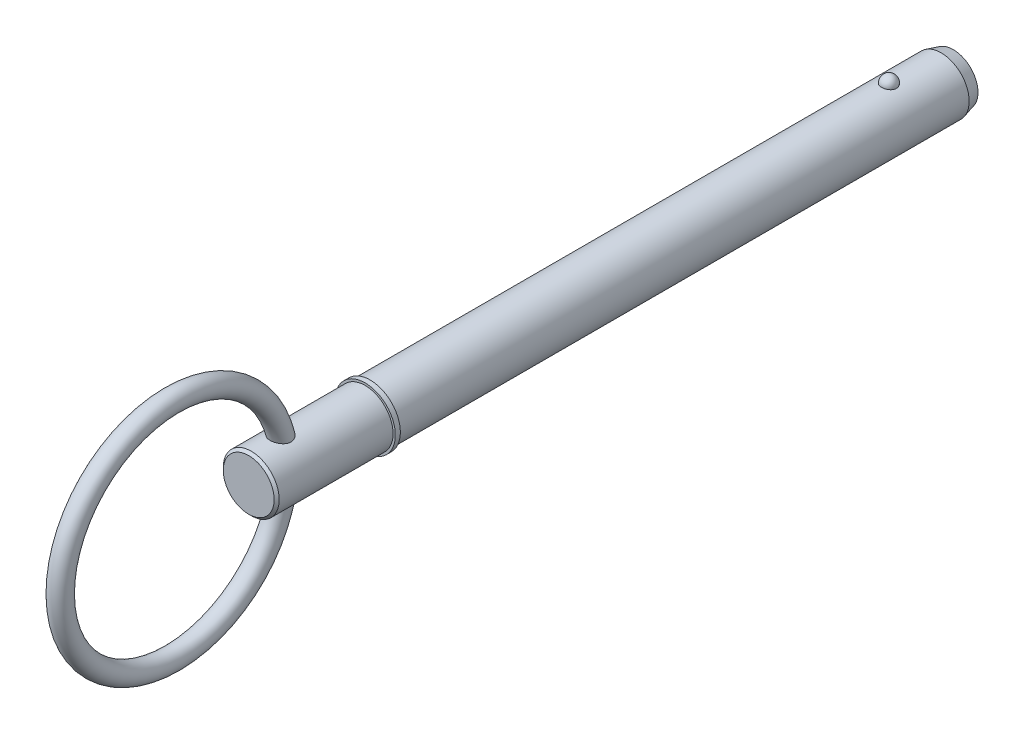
ISO-10303-21;
HEADER;
FILE_DESCRIPTION(('STEP AP214'),'2;1');
FILE_NAME('part.step','',(''),(''),'','','');
FILE_SCHEMA(('AUTOMOTIVE_DESIGN { 1 0 10303 214 1 1 1 1 }'));
ENDSEC;
DATA;
#1=APPLICATION_CONTEXT('core data for automotive mechanical design processes');
#2=APPLICATION_PROTOCOL_DEFINITION('international standard','automotive_design',2000,#1);
#3=PRODUCT_CONTEXT('',#1,'mechanical');
#4=PRODUCT('Part','Part','',(#3));
#5=PRODUCT_RELATED_PRODUCT_CATEGORY('part','',(#4));
#6=PRODUCT_DEFINITION_FORMATION('','',#4);
#7=PRODUCT_DEFINITION_CONTEXT('part definition',#1,'design');
#8=PRODUCT_DEFINITION('design','',#6,#7);
#9=PRODUCT_DEFINITION_SHAPE('','',#8);
#10=(LENGTH_UNIT() NAMED_UNIT(*) SI_UNIT(.MILLI.,.METRE.));
#11=(NAMED_UNIT(*) PLANE_ANGLE_UNIT() SI_UNIT($,.RADIAN.));
#12=(NAMED_UNIT(*) SI_UNIT($,.STERADIAN.) SOLID_ANGLE_UNIT());
#13=UNCERTAINTY_MEASURE_WITH_UNIT(LENGTH_MEASURE(1.E-05),#10,'distance_accuracy_value','');
#14=(GEOMETRIC_REPRESENTATION_CONTEXT(3) GLOBAL_UNCERTAINTY_ASSIGNED_CONTEXT((#13)) GLOBAL_UNIT_ASSIGNED_CONTEXT((#10,
#11,#12)) REPRESENTATION_CONTEXT('',''));
#15=CARTESIAN_POINT('',(0.,0.,0.));
#16=DIRECTION('',(0.,0.,1.));
#17=DIRECTION('',(1.,0.,0.));
#18=AXIS2_PLACEMENT_3D('',#15,#16,#17);
#19=CARTESIAN_POINT('',(0.,0.,101.6));
#20=DIRECTION('',(0.,0.,-1.));
#21=DIRECTION('',(-1.,0.,0.));
#22=AXIS2_PLACEMENT_3D('',#19,#20,#21);
#23=CYLINDRICAL_SURFACE('',#22,5.555);
#24=CARTESIAN_POINT('',(1.47653932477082,5.35517101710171,-1.49));
#25=CARTESIAN_POINT('',(1.4765376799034,5.35517235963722,-1.40667872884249));
#26=CARTESIAN_POINT('',(1.4697233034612,5.35706459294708,-1.32333626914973));
#27=CARTESIAN_POINT('',(1.4426291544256,5.36442332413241,-1.15900769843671));
#28=CARTESIAN_POINT('',(1.42234344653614,5.36989139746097,-1.07802264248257));
#29=CARTESIAN_POINT('',(1.36882802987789,5.38378061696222,-0.920757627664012));
#30=CARTESIAN_POINT('',(1.33560404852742,5.39220045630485,-0.844475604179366));
#31=CARTESIAN_POINT('',(1.25704906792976,5.41105136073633,-0.698703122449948));
#32=CARTESIAN_POINT('',(1.21171855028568,5.42148234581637,-0.629212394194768));
#33=CARTESIAN_POINT('',(1.10986325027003,5.44324765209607,-0.498626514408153));
#34=CARTESIAN_POINT('',(1.05328868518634,5.45458585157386,-0.437570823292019));
#35=CARTESIAN_POINT('',(0.930545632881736,5.4768596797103,-0.325918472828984));
#36=CARTESIAN_POINT('',(0.864377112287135,5.48779530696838,-0.275321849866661));
#37=CARTESIAN_POINT('',(0.724412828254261,5.50801510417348,-0.186125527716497));
#38=CARTESIAN_POINT('',(0.650637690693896,5.51730356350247,-0.147494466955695));
#39=CARTESIAN_POINT('',(0.497383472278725,5.53322345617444,-0.0831582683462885));
#40=CARTESIAN_POINT('',(0.417904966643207,5.53985515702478,-0.0574518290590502));
#41=CARTESIAN_POINT('',(0.256903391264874,5.54963245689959,-0.0200294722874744));
#42=CARTESIAN_POINT('',(0.17543580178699,5.55283384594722,-0.00808940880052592));
#43=CARTESIAN_POINT('',(0.011588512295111,5.55559187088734,0.00221439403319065));
#44=CARTESIAN_POINT('',(-0.0707911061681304,5.55514883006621,0.000579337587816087));
#45=CARTESIAN_POINT('',(-0.232980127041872,5.55069756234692,-0.0161051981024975));
#46=CARTESIAN_POINT('',(-0.312809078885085,5.54673626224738,-0.0309781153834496));
#47=CARTESIAN_POINT('',(-0.468771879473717,5.5357377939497,-0.0734743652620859));
#48=CARTESIAN_POINT('',(-0.544905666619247,5.52870057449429,-0.101097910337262));
#49=CARTESIAN_POINT('',(-0.691800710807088,5.51225307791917,-0.168516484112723));
#50=CARTESIAN_POINT('',(-0.762530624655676,5.50283015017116,-0.2083766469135));
#51=CARTESIAN_POINT('',(-0.896294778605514,5.48263289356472,-0.299136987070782));
#52=CARTESIAN_POINT('',(-0.959328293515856,5.47185843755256,-0.350038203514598));
#53=CARTESIAN_POINT('',(-1.07712789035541,5.44990641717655,-0.462517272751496));
#54=CARTESIAN_POINT('',(-1.13172901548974,5.43872509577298,-0.524267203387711));
#55=CARTESIAN_POINT('',(-1.2299173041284,5.41736658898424,-0.656133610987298));
#56=CARTESIAN_POINT('',(-1.2735037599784,5.40718946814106,-0.726250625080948));
#57=CARTESIAN_POINT('',(-1.34896420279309,5.38886361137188,-0.873713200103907));
#58=CARTESIAN_POINT('',(-1.38071142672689,5.38073711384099,-0.951126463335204));
#59=CARTESIAN_POINT('',(-1.4310375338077,5.36757288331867,-1.11037033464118));
#60=CARTESIAN_POINT('',(-1.44961676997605,5.3625350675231,-1.19220082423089));
#61=CARTESIAN_POINT('',(-1.47308754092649,5.35613553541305,-1.35761209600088));
#62=CARTESIAN_POINT('',(-1.47803294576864,5.35475935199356,-1.44118467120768));
#63=CARTESIAN_POINT('',(-1.47426441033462,5.35579807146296,-1.6079958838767));
#64=CARTESIAN_POINT('',(-1.46555080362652,5.35821288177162,-1.69123452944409));
#65=CARTESIAN_POINT('',(-1.43475662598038,5.36653964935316,-1.8546288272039));
#66=CARTESIAN_POINT('',(-1.41273621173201,5.37243586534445,-1.93479663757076));
#67=CARTESIAN_POINT('',(-1.35593151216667,5.38705199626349,-2.09020110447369));
#68=CARTESIAN_POINT('',(-1.32114675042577,5.39577201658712,-2.16543757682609));
#69=CARTESIAN_POINT('',(-1.23947506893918,5.41511674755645,-2.30926926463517));
#70=CARTESIAN_POINT('',(-1.1925277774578,5.42575087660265,-2.37782893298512));
#71=CARTESIAN_POINT('',(-1.08780725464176,5.44771095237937,-2.50598876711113));
#72=CARTESIAN_POINT('',(-1.03003365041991,5.4590369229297,-2.56558862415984));
#73=CARTESIAN_POINT('',(-0.90495349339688,5.48116073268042,-2.67436535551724));
#74=CARTESIAN_POINT('',(-0.837616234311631,5.49195671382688,-2.7235073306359));
#75=CARTESIAN_POINT('',(-0.69537970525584,5.51177099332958,-2.8097317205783));
#76=CARTESIAN_POINT('',(-0.620480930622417,5.52078940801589,-2.84681492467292));
#77=CARTESIAN_POINT('',(-0.466144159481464,5.53594369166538,-2.90749751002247));
#78=CARTESIAN_POINT('',(-0.386768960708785,5.54211181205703,-2.93124844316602));
#79=CARTESIAN_POINT('',(-0.224991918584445,5.5510324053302,-2.96523308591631));
#80=CARTESIAN_POINT('',(-0.142590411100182,5.55378525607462,-2.97546829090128));
#81=CARTESIAN_POINT('',(0.0213711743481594,5.55555351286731,-2.98206550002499));
#82=CARTESIAN_POINT('',(0.102921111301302,5.55463281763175,-2.97866468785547));
#83=CARTESIAN_POINT('',(0.2642564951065,5.54929804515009,-2.95862186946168));
#84=CARTESIAN_POINT('',(0.344041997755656,5.54488407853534,-2.94198028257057));
#85=CARTESIAN_POINT('',(0.499344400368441,5.53305794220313,-2.89600357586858));
#86=CARTESIAN_POINT('',(0.574874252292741,5.52565550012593,-2.86670961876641));
#87=CARTESIAN_POINT('',(0.71989857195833,5.50863937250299,-2.79624249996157));
#88=CARTESIAN_POINT('',(0.78939269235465,5.49902555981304,-2.75506865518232));
#89=CARTESIAN_POINT('',(0.921480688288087,5.47845199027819,-2.66127110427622));
#90=CARTESIAN_POINT('',(0.983960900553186,5.46747485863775,-2.60849118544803));
#91=CARTESIAN_POINT('',(1.09925057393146,5.44546837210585,-2.49325304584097));
#92=CARTESIAN_POINT('',(1.15205830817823,5.43443900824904,-2.43079310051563));
#93=CARTESIAN_POINT('',(1.24742943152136,5.41335152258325,-2.29680711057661));
#94=CARTESIAN_POINT('',(1.28981661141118,5.40331162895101,-2.22515272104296));
#95=CARTESIAN_POINT('',(1.36214937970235,5.38553336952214,-2.07558035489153));
#96=CARTESIAN_POINT('',(1.39210034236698,5.37779400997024,-1.99766510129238));
#97=CARTESIAN_POINT('',(1.43569518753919,5.36630594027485,-1.84848338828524));
#98=CARTESIAN_POINT('',(1.45098536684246,5.36216169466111,-1.77772322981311));
#99=CARTESIAN_POINT('',(1.47140805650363,5.35659367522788,-1.63464735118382));
#100=CARTESIAN_POINT('',(1.47654075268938,5.35516985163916,-1.5623316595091));
#101=CARTESIAN_POINT('',(1.47653932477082,5.35517101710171,-1.49));
#102=B_SPLINE_CURVE_WITH_KNOTS('',3,(#24,#25,#26,#27,#28,#29,#30,#31,#32,#33,#34,#35,#36,#37,
#38,#39,#40,#41,#42,#43,#44,#45,#46,#47,#48,#49,#50,#51,#52,#53,#54,#55,#56,#57,#58,#59,#60,#61,
#62,#63,#64,#65,#66,#67,#68,#69,#70,#71,#72,#73,#74,#75,#76,#77,#78,#79,#80,#81,#82,#83,#84,#85,
#86,#87,#88,#89,#90,#91,#92,#93,#94,#95,#96,#97,#98,#99,#100,#101),.UNSPECIFIED.,.T.,.F.,(4,2,2,
2,2,2,2,2,2,2,2,2,2,2,2,2,2,2,2,2,2,2,2,2,2,2,2,2,2,2,2,2,2,2,2,2,2,2,4),(0.,0.249703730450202,
0.4995175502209,0.749220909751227,0.998914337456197,1.24973894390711,1.50056442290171,
1.75072681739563,2.00086401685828,2.24686822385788,2.49285060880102,2.73560052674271,
2.97835449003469,3.22242369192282,3.46651587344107,3.71490232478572,3.96330473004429,
4.21429522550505,4.46527899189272,4.71526963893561,4.96525418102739,5.21411697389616,
5.46298905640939,5.71312097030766,5.96326150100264,6.21422412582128,6.46517032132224,
6.71320296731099,6.96120816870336,7.20491846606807,7.44862104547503,7.69153667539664,
7.93446627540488,8.18089104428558,8.42735976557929,8.67774679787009,8.92802551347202,
9.14479867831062,9.36156787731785),.UNSPECIFIED.);
#103=CARTESIAN_POINT('',(1.47653932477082,5.35517101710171,-1.49));
#104=VERTEX_POINT('',#103);
#105=EDGE_CURVE('E101',#104,#104,#102,.T.);
#106=ORIENTED_EDGE('',*,*,#105,.T.);
#107=EDGE_LOOP('',(#106));
#108=FACE_BOUND('',#107,.T.);
#109=CARTESIAN_POINT('',(0.,0.,-11.87));
#110=DIRECTION('',(0.,0.,-1.));
#111=DIRECTION('',(-1.,0.,0.));
#112=AXIS2_PLACEMENT_3D('',#109,#110,#111);
#113=CIRCLE('',#112,5.555);
#114=CARTESIAN_POINT('',(5.555,0.,-11.87));
#115=VERTEX_POINT('',#114);
#116=EDGE_CURVE('E109',#115,#115,#113,.F.);
#117=ORIENTED_EDGE('',*,*,#116,.T.);
#118=EDGE_LOOP('',(#117));
#119=FACE_BOUND('',#118,.T.);
#120=CARTESIAN_POINT('',(0.,0.,101.6));
#121=DIRECTION('',(0.,0.,1.));
#122=DIRECTION('',(1.,0.,0.));
#123=AXIS2_PLACEMENT_3D('',#120,#121,#122);
#124=CIRCLE('',#123,5.555);
#125=CARTESIAN_POINT('',(5.555,0.,101.6));
#126=VERTEX_POINT('',#125);
#127=EDGE_CURVE('E107',#126,#126,#124,.T.);
#128=ORIENTED_EDGE('',*,*,#127,.F.);
#129=EDGE_LOOP('',(#128));
#130=FACE_BOUND('',#129,.T.);
#131=ADVANCED_FACE('F39',(#108,#119,#130),#23,.T.);
#132=CARTESIAN_POINT('',(0.,0.,-14.27));
#133=DIRECTION('',(0.,0.,-1.));
#134=DIRECTION('',(-1.,0.,0.));
#135=AXIS2_PLACEMENT_3D('',#132,#133,#134);
#136=PLANE('',#135);
#137=CARTESIAN_POINT('',(0.,0.,-14.27));
#138=DIRECTION('',(0.,0.,-1.));
#139=DIRECTION('',(-1.,0.,0.));
#140=AXIS2_PLACEMENT_3D('',#137,#138,#139);
#141=CIRCLE('',#140,4.91192193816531);
#142=CARTESIAN_POINT('',(4.91192193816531,0.,-14.27));
#143=VERTEX_POINT('',#142);
#144=EDGE_CURVE('E142',#143,#143,#141,.T.);
#145=ORIENTED_EDGE('',*,*,#144,.T.);
#146=EDGE_LOOP('',(#145));
#147=FACE_BOUND('',#146,.T.);
#148=ADVANCED_FACE('F87',(#147),#136,.T.);
#149=CARTESIAN_POINT('',(0.,0.,-14.27));
#150=DIRECTION('',(0.,0.,1.));
#151=DIRECTION('',(1.,0.,0.));
#152=AXIS2_PLACEMENT_3D('',#149,#150,#151);
#153=CONICAL_SURFACE('',#152,4.91192193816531,0.261799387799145);
#154=CARTESIAN_POINT('',(5.555,0.,-11.87));
#155=CARTESIAN_POINT('',(5.54830127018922,0.,-11.895));
#156=CARTESIAN_POINT('',(5.54160254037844,0.,-11.92));
#157=CARTESIAN_POINT('',(5.52820508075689,0.,-11.97));
#158=CARTESIAN_POINT('',(5.52150635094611,0.,-11.995));
#159=CARTESIAN_POINT('',(5.50810889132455,0.,-12.045));
#160=CARTESIAN_POINT('',(5.50141016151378,0.,-12.07));
#161=CARTESIAN_POINT('',(5.48801270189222,0.,-12.12));
#162=CARTESIAN_POINT('',(5.48131397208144,0.,-12.145));
#163=CARTESIAN_POINT('',(5.46791651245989,0.,-12.195));
#164=CARTESIAN_POINT('',(5.46121778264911,0.,-12.22));
#165=CARTESIAN_POINT('',(5.44782032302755,0.,-12.27));
#166=CARTESIAN_POINT('',(5.44112159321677,0.,-12.295));
#167=CARTESIAN_POINT('',(5.42772413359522,0.,-12.345));
#168=CARTESIAN_POINT('',(5.42102540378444,0.,-12.37));
#169=CARTESIAN_POINT('',(5.40762794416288,0.,-12.42));
#170=CARTESIAN_POINT('',(5.40092921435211,0.,-12.445));
#171=CARTESIAN_POINT('',(5.38753175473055,0.,-12.495));
#172=CARTESIAN_POINT('',(5.38083302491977,0.,-12.52));
#173=CARTESIAN_POINT('',(5.36743556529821,0.,-12.57));
#174=CARTESIAN_POINT('',(5.36073683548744,0.,-12.595));
#175=CARTESIAN_POINT('',(5.34733937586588,0.,-12.645));
#176=CARTESIAN_POINT('',(5.3406406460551,0.,-12.67));
#177=CARTESIAN_POINT('',(5.32724318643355,0.,-12.72));
#178=CARTESIAN_POINT('',(5.32054445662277,0.,-12.745));
#179=CARTESIAN_POINT('',(5.30714699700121,0.,-12.795));
#180=CARTESIAN_POINT('',(5.30044826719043,0.,-12.82));
#181=CARTESIAN_POINT('',(5.28705080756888,0.,-12.87));
#182=CARTESIAN_POINT('',(5.2803520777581,0.,-12.895));
#183=CARTESIAN_POINT('',(5.26695461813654,0.,-12.945));
#184=CARTESIAN_POINT('',(5.26025588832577,0.,-12.97));
#185=CARTESIAN_POINT('',(5.24685842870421,0.,-13.02));
#186=CARTESIAN_POINT('',(5.24015969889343,0.,-13.045));
#187=CARTESIAN_POINT('',(5.22676223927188,0.,-13.095));
#188=CARTESIAN_POINT('',(5.2200635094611,0.,-13.12));
#189=CARTESIAN_POINT('',(5.20666604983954,0.,-13.17));
#190=CARTESIAN_POINT('',(5.19996732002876,0.,-13.195));
#191=CARTESIAN_POINT('',(5.18656986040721,0.,-13.245));
#192=CARTESIAN_POINT('',(5.17987113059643,0.,-13.27));
#193=CARTESIAN_POINT('',(5.16647367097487,0.,-13.32));
#194=CARTESIAN_POINT('',(5.1597749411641,0.,-13.345));
#195=CARTESIAN_POINT('',(5.14637748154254,0.,-13.395));
#196=CARTESIAN_POINT('',(5.13967875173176,0.,-13.42));
#197=CARTESIAN_POINT('',(5.12628129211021,0.,-13.47));
#198=CARTESIAN_POINT('',(5.11958256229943,0.,-13.495));
#199=CARTESIAN_POINT('',(5.10618510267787,0.,-13.545));
#200=CARTESIAN_POINT('',(5.09948637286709,0.,-13.57));
#201=CARTESIAN_POINT('',(5.08608891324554,0.,-13.62));
#202=CARTESIAN_POINT('',(5.07939018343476,0.,-13.645));
#203=CARTESIAN_POINT('',(5.0659927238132,0.,-13.695));
#204=CARTESIAN_POINT('',(5.05929399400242,0.,-13.72));
#205=CARTESIAN_POINT('',(5.04589653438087,0.,-13.77));
#206=CARTESIAN_POINT('',(5.03919780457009,0.,-13.795));
#207=CARTESIAN_POINT('',(5.02580034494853,0.,-13.845));
#208=CARTESIAN_POINT('',(5.01910161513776,0.,-13.87));
#209=CARTESIAN_POINT('',(5.0057041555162,0.,-13.92));
#210=CARTESIAN_POINT('',(4.99900542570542,0.,-13.945));
#211=CARTESIAN_POINT('',(4.98560796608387,0.,-13.995));
#212=CARTESIAN_POINT('',(4.97890923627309,0.,-14.02));
#213=CARTESIAN_POINT('',(4.96551177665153,0.,-14.07));
#214=CARTESIAN_POINT('',(4.95881304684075,0.,-14.095));
#215=CARTESIAN_POINT('',(4.9454155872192,0.,-14.145));
#216=CARTESIAN_POINT('',(4.93871685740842,0.,-14.17));
#217=CARTESIAN_POINT('',(4.92531939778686,0.,-14.22));
#218=CARTESIAN_POINT('',(4.91862066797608,0.,-14.245));
#219=CARTESIAN_POINT('',(4.91192193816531,0.,-14.27));
#220=B_SPLINE_CURVE_WITH_KNOTS('',3,(#154,#155,#156,#157,#158,#159,#160,#161,#162,#163,#164,
#165,#166,#167,#168,#169,#170,#171,#172,#173,#174,#175,#176,#177,#178,#179,#180,#181,#182,#183,
#184,#185,#186,#187,#188,#189,#190,#191,#192,#193,#194,#195,#196,#197,#198,#199,#200,#201,#202,
#203,#204,#205,#206,#207,#208,#209,#210,#211,#212,#213,#214,#215,#216,#217,#218,#219),
.UNSPECIFIED.,.F.,.F.,(4,2,2,2,2,2,2,2,2,2,2,2,2,2,2,2,2,2,2,2,2,2,2,2,2,2,2,2,2,2,2,2,4),(0.,
0.0776457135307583,0.155291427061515,0.232937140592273,0.31058285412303,0.388228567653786,
0.465874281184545,0.543519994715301,0.621165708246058,0.698811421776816,0.776457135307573,
0.854102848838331,0.931748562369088,1.00939427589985,1.0870399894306,1.16468570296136,
1.24233141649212,1.31997713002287,1.39762284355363,1.47526855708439,1.55291427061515,
1.6305599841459,1.70820569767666,1.78585141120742,1.86349712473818,1.94114283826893,
2.01878855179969,2.09643426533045,2.17407997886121,2.25172569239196,2.32937140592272,
2.40701711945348,2.48466283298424),.UNSPECIFIED.);
#221=EDGE_CURVE('BSEAM93',#115,#143,#220,.T.);
#222=ORIENTED_EDGE('',*,*,#116,.F.);
#223=ORIENTED_EDGE('',*,*,#144,.F.);
#224=ORIENTED_EDGE('',*,*,#221,.T.);
#225=ORIENTED_EDGE('',*,*,#221,.F.);
#226=EDGE_LOOP('',(#222,#224,#223,#225));
#227=FACE_BOUND('',#226,.T.);
#228=ADVANCED_FACE('F93',(#227),#153,.T.);
#229=CARTESIAN_POINT('',(0.,5.555,-1.49));
#230=DIRECTION('',(0.,1.,0.));
#231=DIRECTION('',(0.,0.,1.));
#232=AXIS2_PLACEMENT_3D('',#229,#230,#231);
#233=SPHERICAL_SURFACE('',#232,1.49);
#234=ORIENTED_EDGE('',*,*,#105,.F.);
#235=EDGE_LOOP('',(#234));
#236=FACE_BOUND('',#235,.T.);
#237=ADVANCED_FACE('F112',(#236),#233,.T.);
#238=CARTESIAN_POINT('',(0.,0.,101.6));
#239=DIRECTION('',(0.,0.,-1.));
#240=DIRECTION('',(-1.,0.,0.));
#241=AXIS2_PLACEMENT_3D('',#238,#239,#240);
#242=PLANE('',#241);
#243=ORIENTED_EDGE('',*,*,#127,.T.);
#244=EDGE_LOOP('',(#243));
#245=FACE_BOUND('',#244,.T.);
#246=CARTESIAN_POINT('',(0.,0.,101.6));
#247=DIRECTION('',(0.,0.,-1.));
#248=DIRECTION('',(-1.,0.,0.));
#249=AXIS2_PLACEMENT_3D('',#246,#247,#248);
#250=CIRCLE('',#249,6.);
#251=CARTESIAN_POINT('',(-6.,0.,101.6));
#252=VERTEX_POINT('',#251);
#253=EDGE_CURVE('E108',#252,#252,#250,.T.);
#254=ORIENTED_EDGE('',*,*,#253,.T.);
#255=EDGE_LOOP('',(#254));
#256=FACE_BOUND('',#255,.T.);
#257=ADVANCED_FACE('F116',(#245,#256),#242,.T.);
#258=CARTESIAN_POINT('',(0.,0.,33.7287874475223));
#259=DIRECTION('',(0.,0.,-1.));
#260=DIRECTION('',(-1.,0.,0.));
#261=AXIS2_PLACEMENT_3D('',#258,#259,#260);
#262=CYLINDRICAL_SURFACE('',#261,6.);
#263=CARTESIAN_POINT('',(0.,0.,102.6));
#264=DIRECTION('',(0.,0.,-1.));
#265=DIRECTION('',(-1.,0.,0.));
#266=AXIS2_PLACEMENT_3D('',#263,#264,#265);
#267=CIRCLE('',#266,6.);
#268=CARTESIAN_POINT('',(-6.,0.,102.6));
#269=VERTEX_POINT('',#268);
#270=EDGE_CURVE('E133',#269,#269,#267,.T.);
#271=ORIENTED_EDGE('',*,*,#270,.T.);
#272=EDGE_LOOP('',(#271));
#273=FACE_BOUND('',#272,.T.);
#274=ORIENTED_EDGE('',*,*,#253,.F.);
#275=EDGE_LOOP('',(#274));
#276=FACE_BOUND('',#275,.T.);
#277=ADVANCED_FACE('F120',(#273,#276),#262,.T.);
#278=CARTESIAN_POINT('',(0.,6.,102.6));
#279=DIRECTION('',(0.,0.,1.));
#280=DIRECTION('',(1.,0.,0.));
#281=AXIS2_PLACEMENT_3D('',#278,#279,#280);
#282=PLANE('',#281);
#283=CARTESIAN_POINT('',(0.,0.,102.6));
#284=DIRECTION('',(0.,0.,1.));
#285=DIRECTION('',(1.,0.,0.));
#286=AXIS2_PLACEMENT_3D('',#283,#284,#285);
#287=CIRCLE('',#286,5.555);
#288=CARTESIAN_POINT('',(5.555,0.,102.6));
#289=VERTEX_POINT('',#288);
#290=EDGE_CURVE('E111',#289,#289,#287,.T.);
#291=ORIENTED_EDGE('',*,*,#290,.F.);
#292=EDGE_LOOP('',(#291));
#293=FACE_BOUND('',#292,.T.);
#294=ORIENTED_EDGE('',*,*,#270,.F.);
#295=EDGE_LOOP('',(#294));
#296=FACE_BOUND('',#295,.T.);
#297=ADVANCED_FACE('F84',(#293,#296),#282,.T.);
#298=CARTESIAN_POINT('',(0.,0.,125.73));
#299=DIRECTION('',(0.,0.,-1.));
#300=DIRECTION('',(-1.,0.,0.));
#301=AXIS2_PLACEMENT_3D('',#298,#299,#300);
#302=CYLINDRICAL_SURFACE('',#301,5.555);
#303=CARTESIAN_POINT('',(-0.961380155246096,-5.47117658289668,117.608733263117));
#304=CARTESIAN_POINT('',(-0.863231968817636,-5.48842171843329,117.557515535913));
#305=CARTESIAN_POINT('',(-0.7605484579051,-5.50372118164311,117.514318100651));
#306=CARTESIAN_POINT('',(-0.548956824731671,-5.52883500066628,117.444912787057));
#307=CARTESIAN_POINT('',(-0.440048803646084,-5.53864944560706,117.418704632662));
#308=CARTESIAN_POINT('',(-0.219033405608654,-5.55178384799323,117.383864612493));
#309=CARTESIAN_POINT('',(-0.106925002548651,-5.55510169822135,117.375238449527));
#310=CARTESIAN_POINT('',(0.11723899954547,-5.55489351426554,117.375783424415));
#311=CARTESIAN_POINT('',(0.229294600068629,-5.55136768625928,117.384954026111));
#312=CARTESIAN_POINT('',(0.449588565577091,-5.5378711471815,117.420784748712));
#313=CARTESIAN_POINT('',(0.557843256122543,-5.52793284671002,117.447356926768));
#314=CARTESIAN_POINT('',(0.768116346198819,-5.50265785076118,117.517309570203));
#315=CARTESIAN_POINT('',(0.87013418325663,-5.48732066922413,117.560691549));
#316=CARTESIAN_POINT('',(1.06580880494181,-5.45270790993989,117.663685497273));
#317=CARTESIAN_POINT('',(1.1594033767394,-5.43340601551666,117.723406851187));
#318=CARTESIAN_POINT('',(1.33484934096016,-5.39298781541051,117.857672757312));
#319=CARTESIAN_POINT('',(1.41670019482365,-5.37187142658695,117.932217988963));
#320=CARTESIAN_POINT('',(1.56628651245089,-5.33017932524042,118.094433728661));
#321=CARTESIAN_POINT('',(1.63402728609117,-5.30960341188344,118.182099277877));
#322=CARTESIAN_POINT('',(1.7533832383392,-5.27139606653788,118.36835593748));
#323=CARTESIAN_POINT('',(1.80500413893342,-5.25376359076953,118.466943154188));
#324=CARTESIAN_POINT('',(1.88923054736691,-5.22405733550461,118.668866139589));
#325=CARTESIAN_POINT('',(1.92240068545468,-5.21182119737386,118.771942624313));
#326=CARTESIAN_POINT('',(1.97156802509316,-5.19342304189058,118.982612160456));
#327=CARTESIAN_POINT('',(1.98756752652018,-5.18726021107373,119.090204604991));
#328=CARTESIAN_POINT('',(2.00238957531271,-5.1815556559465,119.304813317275));
#329=CARTESIAN_POINT('',(2.0015062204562,-5.18190056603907,119.411807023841));
#330=CARTESIAN_POINT('',(1.98404322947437,-5.18861029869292,119.624294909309));
#331=CARTESIAN_POINT('',(1.96745884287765,-5.19497694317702,119.72978862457));
#332=CARTESIAN_POINT('',(1.91810947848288,-5.21340722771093,119.943734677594));
#333=CARTESIAN_POINT('',(1.88435438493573,-5.22581720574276,120.051927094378));
#334=CARTESIAN_POINT('',(1.80161540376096,-5.25491400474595,120.261718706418));
#335=CARTESIAN_POINT('',(1.75262312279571,-5.27160318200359,120.363314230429));
#336=CARTESIAN_POINT('',(1.63431251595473,-5.30955034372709,120.568856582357));
#337=CARTESIAN_POINT('',(1.56333412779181,-5.33111051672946,120.671796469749));
#338=CARTESIAN_POINT('',(1.40529607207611,-5.37493145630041,120.86447165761));
#339=CARTESIAN_POINT('',(1.31822569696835,-5.39719268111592,120.954198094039));
#340=CARTESIAN_POINT('',(1.12728892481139,-5.44031451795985,121.119004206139));
#341=CARTESIAN_POINT('',(1.02309899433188,-5.46113424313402,121.193723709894));
#342=CARTESIAN_POINT('',(0.801576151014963,-5.49800171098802,121.321805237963));
#343=CARTESIAN_POINT('',(0.684264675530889,-5.51405708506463,121.375201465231));
#344=CARTESIAN_POINT('',(0.456877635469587,-5.53719478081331,121.450980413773));
#345=CARTESIAN_POINT('',(0.34797457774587,-5.54519800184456,121.476584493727));
#346=CARTESIAN_POINT('',(0.12704223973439,-5.55464249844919,121.506731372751));
#347=CARTESIAN_POINT('',(0.0150164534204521,-5.55609083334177,121.511296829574));
#348=CARTESIAN_POINT('',(-0.191993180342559,-5.55250986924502,121.499911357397));
#349=CARTESIAN_POINT('',(-0.287160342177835,-5.54836194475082,121.486752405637));
#350=CARTESIAN_POINT('',(-0.473863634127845,-5.53554271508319,121.445489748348));
#351=CARTESIAN_POINT('',(-0.565399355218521,-5.52687090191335,121.417384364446));
#352=CARTESIAN_POINT('',(-0.743786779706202,-5.50572322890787,121.347293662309));
#353=CARTESIAN_POINT('',(-0.830566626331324,-5.49320168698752,121.305141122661));
#354=CARTESIAN_POINT('',(-0.996720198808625,-5.46549909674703,121.208875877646));
#355=CARTESIAN_POINT('',(-1.07609119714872,-5.45031707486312,121.154758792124));
#356=CARTESIAN_POINT('',(-1.23672272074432,-5.41628785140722,121.028211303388));
#357=CARTESIAN_POINT('',(-1.31676039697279,-5.39722327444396,120.95428911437));
#358=CARTESIAN_POINT('',(-1.46504263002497,-5.3588760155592,120.795462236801));
#359=CARTESIAN_POINT('',(-1.53327828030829,-5.33959318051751,120.710549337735));
#360=CARTESIAN_POINT('',(-1.6660227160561,-5.29979878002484,120.518697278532));
#361=CARTESIAN_POINT('',(-1.72857256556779,-5.27951148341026,120.410347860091));
#362=CARTESIAN_POINT('',(-1.83559571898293,-5.24326402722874,120.184325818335));
#363=CARTESIAN_POINT('',(-1.88006296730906,-5.22730531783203,120.066650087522));
#364=CARTESIAN_POINT('',(-1.94988009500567,-5.20167534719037,119.822087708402));
#365=CARTESIAN_POINT('',(-1.97477410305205,-5.19215470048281,119.69505279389));
#366=CARTESIAN_POINT('',(-2.00168294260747,-5.18184594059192,119.438249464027));
#367=CARTESIAN_POINT('',(-2.0037221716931,-5.18104851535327,119.30848411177));
#368=CARTESIAN_POINT('',(-1.98467753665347,-5.18836681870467,119.064652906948));
#369=CARTESIAN_POINT('',(-1.96600067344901,-5.19555485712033,118.950370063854));
#370=CARTESIAN_POINT('',(-1.90923541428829,-5.21668050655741,118.727389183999));
#371=CARTESIAN_POINT('',(-1.87115335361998,-5.23061591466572,118.618689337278));
#372=CARTESIAN_POINT('',(-1.78015350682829,-5.26224244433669,118.418371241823));
#373=CARTESIAN_POINT('',(-1.72857344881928,-5.27957041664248,118.32608293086));
#374=CARTESIAN_POINT('',(-1.61106729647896,-5.31660340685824,118.151684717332));
#375=CARTESIAN_POINT('',(-1.54514024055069,-5.33630858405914,118.069575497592));
#376=CARTESIAN_POINT('',(-1.39929408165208,-5.37641320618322,117.915887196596));
#377=CARTESIAN_POINT('',(-1.31912544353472,-5.39681868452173,117.844546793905));
#378=CARTESIAN_POINT('',(-1.14786008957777,-5.43582099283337,117.715855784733));
#379=CARTESIAN_POINT('',(-1.05676174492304,-5.4544175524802,117.658507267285));
#380=CARTESIAN_POINT('',(-0.961380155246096,-5.47117658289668,117.608733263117));
#381=B_SPLINE_CURVE_WITH_KNOTS('',3,(#303,#304,#305,#306,#307,#308,#309,#310,#311,#312,#313,
#314,#315,#316,#317,#318,#319,#320,#321,#322,#323,#324,#325,#326,#327,#328,#329,#330,#331,#332,
#333,#334,#335,#336,#337,#338,#339,#340,#341,#342,#343,#344,#345,#346,#347,#348,#349,#350,#351,
#352,#353,#354,#355,#356,#357,#358,#359,#360,#361,#362,#363,#364,#365,#366,#367,#368,#369,#370,
#371,#372,#373,#374,#375,#376,#377,#378,#379,#380),.UNSPECIFIED.,.T.,.F.,(4,2,2,2,2,2,2,2,2,2,2,
2,2,2,2,2,2,2,2,2,2,2,2,2,2,2,2,2,2,2,2,2,2,2,2,2,2,2,4),(0.,0.335747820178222,0.67149018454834,
1.0073414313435,1.3431825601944,1.6773394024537,2.01152633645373,2.3480076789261,
2.68450444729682,3.02087435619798,3.35712472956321,3.68242216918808,4.0076760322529,
4.32726924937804,4.6469591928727,4.98762165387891,5.32847210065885,5.7074287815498,
6.08663853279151,6.47407889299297,6.86089527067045,7.19531213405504,7.52936875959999,
7.81649827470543,8.10366003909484,8.39437023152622,8.68518702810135,9.01572837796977,
9.34651809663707,9.72504519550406,10.1036989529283,10.4909301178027,10.8777478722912,
11.2239231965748,11.5699855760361,11.8899109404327,12.2098577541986,12.5360928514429,
12.8623766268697),.UNSPECIFIED.);
#382=CARTESIAN_POINT('',(-0.961380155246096,-5.47117658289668,117.608733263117));
#383=VERTEX_POINT('',#382);
#384=EDGE_CURVE('E10',#383,#383,#381,.T.);
#385=ORIENTED_EDGE('',*,*,#384,.F.);
#386=EDGE_LOOP('',(#385));
#387=FACE_BOUND('',#386,.T.);
#388=CARTESIAN_POINT('',(-0.961380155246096,5.47117658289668,117.608733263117));
#389=CARTESIAN_POINT('',(-1.05891474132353,5.45403910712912,117.659631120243));
#390=CARTESIAN_POINT('',(-1.15197270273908,5.43497920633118,117.718451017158));
#391=CARTESIAN_POINT('',(-1.32661268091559,5.39501222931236,117.85070162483));
#392=CARTESIAN_POINT('',(-1.40819495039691,5.37410519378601,117.924132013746));
#393=CARTESIAN_POINT('',(-1.55769110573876,5.33269731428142,118.084098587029));
#394=CARTESIAN_POINT('',(-1.62558729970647,5.3121970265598,118.170651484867));
#395=CARTESIAN_POINT('',(-1.74556031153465,5.27399510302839,118.354646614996));
#396=CARTESIAN_POINT('',(-1.7976419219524,5.25629262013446,118.452085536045));
#397=CARTESIAN_POINT('',(-1.88339939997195,5.22617061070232,118.652565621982));
#398=CARTESIAN_POINT('',(-1.91750373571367,5.21362983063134,118.755405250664));
#399=CARTESIAN_POINT('',(-1.96852412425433,5.194582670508,118.965778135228));
#400=CARTESIAN_POINT('',(-1.98544249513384,5.18807547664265,119.073310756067));
#401=CARTESIAN_POINT('',(-2.00201964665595,5.18170011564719,119.287819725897));
#402=CARTESIAN_POINT('',(-2.00199605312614,5.18170977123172,119.394768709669));
#403=CARTESIAN_POINT('',(-1.98621575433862,5.18777751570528,119.607306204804));
#404=CARTESIAN_POINT('',(-1.97045441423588,5.19383738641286,119.712894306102));
#405=CARTESIAN_POINT('',(-1.92280904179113,5.21167084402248,119.926914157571));
#406=CARTESIAN_POINT('',(-1.88996782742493,5.22378174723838,120.035103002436));
#407=CARTESIAN_POINT('',(-1.8090690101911,5.252344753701,120.245029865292));
#408=CARTESIAN_POINT('',(-1.76100319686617,5.26879919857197,120.346764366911));
#409=CARTESIAN_POINT('',(-1.64464870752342,5.30634509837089,120.552788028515));
#410=CARTESIAN_POINT('',(-1.57469702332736,5.32774959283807,120.656085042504));
#411=CARTESIAN_POINT('',(-1.41872356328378,5.37138743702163,120.849688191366));
#412=CARTESIAN_POINT('',(-1.3326906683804,5.39362135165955,120.939985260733));
#413=CARTESIAN_POINT('',(-1.14345202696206,5.43692909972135,121.106557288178));
#414=CARTESIAN_POINT('',(-1.03986000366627,5.45795811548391,121.182409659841));
#415=CARTESIAN_POINT('',(-0.819338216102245,5.49537389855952,121.312916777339));
#416=CARTESIAN_POINT('',(-0.70242947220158,5.51176784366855,121.367604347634));
#417=CARTESIAN_POINT('',(-0.475167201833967,5.53565843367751,121.44602203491));
#418=CARTESIAN_POINT('',(-0.365997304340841,5.54404610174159,121.472893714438));
#419=CARTESIAN_POINT('',(-0.144272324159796,5.55422966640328,121.505426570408));
#420=CARTESIAN_POINT('',(-0.031721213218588,5.55603301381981,121.511111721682));
#421=CARTESIAN_POINT('',(0.176166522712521,5.55303883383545,121.501592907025));
#422=CARTESIAN_POINT('',(0.271662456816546,5.54914868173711,121.489260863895));
#423=CARTESIAN_POINT('',(0.459140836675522,5.53678955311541,121.449523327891));
#424=CARTESIAN_POINT('',(0.551122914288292,5.52832009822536,121.422116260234));
#425=CARTESIAN_POINT('',(0.730082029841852,5.50755841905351,121.353437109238));
#426=CARTESIAN_POINT('',(0.817013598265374,5.49523641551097,121.312056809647));
#427=CARTESIAN_POINT('',(0.98356924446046,5.46788364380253,121.217293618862));
#428=CARTESIAN_POINT('',(1.06319070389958,5.45285191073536,121.163906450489));
#429=CARTESIAN_POINT('',(1.22430017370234,5.4191117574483,121.038982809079));
#430=CARTESIAN_POINT('',(1.30459540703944,5.40018081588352,120.965970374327));
#431=CARTESIAN_POINT('',(1.45353150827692,5.3620139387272,120.808943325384));
#432=CARTESIAN_POINT('',(1.52216366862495,5.3427777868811,120.724920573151));
#433=CARTESIAN_POINT('',(1.65601602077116,5.30294271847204,120.534811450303));
#434=CARTESIAN_POINT('',(1.71927851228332,5.28255425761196,120.427294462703));
#435=CARTESIAN_POINT('',(1.82790996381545,5.24595721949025,120.202847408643));
#436=CARTESIAN_POINT('',(1.8732722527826,5.22975020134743,120.085913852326));
#437=CARTESIAN_POINT('',(1.94526503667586,5.20341207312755,119.842194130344));
#438=CARTESIAN_POINT('',(1.97135787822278,5.1934564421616,119.71522738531));
#439=CARTESIAN_POINT('',(2.00068973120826,5.18223330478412,119.458318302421));
#440=CARTESIAN_POINT('',(2.00395290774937,5.18095661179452,119.328379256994));
#441=CARTESIAN_POINT('',(1.98717985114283,5.1874070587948,119.083763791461));
#442=CARTESIAN_POINT('',(1.96951989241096,5.19421607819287,118.968899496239));
#443=CARTESIAN_POINT('',(1.91463360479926,5.2146960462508,118.744589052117));
#444=CARTESIAN_POINT('',(1.87741409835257,5.22836460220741,118.635141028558));
#445=CARTESIAN_POINT('',(1.78800305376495,5.25957304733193,118.433542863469));
#446=CARTESIAN_POINT('',(1.73720600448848,5.27672774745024,118.340709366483));
#447=CARTESIAN_POINT('',(1.62116201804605,5.3135255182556,118.165121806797));
#448=CARTESIAN_POINT('',(1.55591428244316,5.33316872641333,118.082368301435));
#449=CARTESIAN_POINT('',(1.41164041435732,5.37317145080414,117.927648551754));
#450=CARTESIAN_POINT('',(1.33241957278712,5.39353732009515,117.855865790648));
#451=CARTESIAN_POINT('',(1.16300716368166,5.43258596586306,117.726112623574));
#452=CARTESIAN_POINT('',(1.07281393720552,5.45126848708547,117.668144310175));
#453=CARTESIAN_POINT('',(0.880638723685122,5.48564753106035,117.565507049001));
#454=CARTESIAN_POINT('',(0.77836470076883,5.50122427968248,117.521343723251));
#455=CARTESIAN_POINT('',(0.567418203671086,5.52696543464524,117.449973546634));
#456=CARTESIAN_POINT('',(0.458745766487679,5.53712987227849,117.42276659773));
#457=CARTESIAN_POINT('',(0.23779150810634,5.55101406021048,117.385879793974));
#458=CARTESIAN_POINT('',(0.12550171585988,5.55471842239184,117.37624178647));
#459=CARTESIAN_POINT('',(-0.0992056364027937,5.55525045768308,117.374849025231));
#460=CARTESIAN_POINT('',(-0.211623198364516,5.55207802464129,117.383094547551));
#461=CARTESIAN_POINT('',(-0.43421780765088,5.53913427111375,117.417408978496));
#462=CARTESIAN_POINT('',(-0.544370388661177,5.52931142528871,117.443617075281));
#463=CARTESIAN_POINT('',(-0.758352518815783,5.50404767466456,117.513395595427));
#464=CARTESIAN_POINT('',(-0.862181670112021,5.48860641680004,117.556967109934));
#465=CARTESIAN_POINT('',(-0.961380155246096,5.47117658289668,117.608733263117));
#466=B_SPLINE_CURVE_WITH_KNOTS('',3,(#388,#389,#390,#391,#392,#393,#394,#395,#396,#397,#398,
#399,#400,#401,#402,#403,#404,#405,#406,#407,#408,#409,#410,#411,#412,#413,#414,#415,#416,#417,
#418,#419,#420,#421,#422,#423,#424,#425,#426,#427,#428,#429,#430,#431,#432,#433,#434,#435,#436,
#437,#438,#439,#440,#441,#442,#443,#444,#445,#446,#447,#448,#449,#450,#451,#452,#453,#454,#455,
#456,#457,#458,#459,#460,#461,#462,#463,#464,#465),.UNSPECIFIED.,.T.,.F.,(4,2,2,2,2,2,2,2,2,2,2,
2,2,2,2,2,2,2,2,2,2,2,2,2,2,2,2,2,2,2,2,2,2,2,2,2,2,2,4),(0.,0.333636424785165,
0.667265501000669,1.00132312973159,1.33527942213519,1.66086829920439,1.98641325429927,
2.30585509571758,2.62539104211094,2.96514840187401,3.30508930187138,3.68313901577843,
4.06145109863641,4.4495380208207,4.83702062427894,5.17316628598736,5.508931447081,
5.79666415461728,6.08442692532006,6.37447144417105,6.66461944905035,6.99384361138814,
7.32331250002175,7.70083591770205,8.07849989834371,8.46633986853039,8.85376924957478,
9.20110411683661,9.54831791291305,9.86844524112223,10.1885902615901,10.513611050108,
10.8386810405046,11.1745469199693,11.5104108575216,11.8470737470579,12.183741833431,
12.5230486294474,12.8623767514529),.UNSPECIFIED.);
#467=CARTESIAN_POINT('',(-0.961380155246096,5.47117658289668,117.608733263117));
#468=VERTEX_POINT('',#467);
#469=EDGE_CURVE('E51',#468,#468,#466,.T.);
#470=ORIENTED_EDGE('',*,*,#469,.F.);
#471=EDGE_LOOP('',(#470));
#472=FACE_BOUND('',#471,.T.);
#473=CARTESIAN_POINT('',(0.,0.,125.23));
#474=DIRECTION('',(0.,0.,-1.));
#475=DIRECTION('',(-1.,0.,0.));
#476=AXIS2_PLACEMENT_3D('',#473,#474,#475);
#477=CIRCLE('',#476,5.555);
#478=CARTESIAN_POINT('',(-5.555,0.,125.23));
#479=VERTEX_POINT('',#478);
#480=EDGE_CURVE('E63',#479,#479,#477,.T.);
#481=ORIENTED_EDGE('',*,*,#480,.T.);
#482=EDGE_LOOP('',(#481));
#483=FACE_BOUND('',#482,.T.);
#484=ORIENTED_EDGE('',*,*,#290,.T.);
#485=EDGE_LOOP('',(#484));
#486=FACE_BOUND('',#485,.T.);
#487=ADVANCED_FACE('F68',(#387,#472,#483,#486),#302,.T.);
#488=CARTESIAN_POINT('',(0.,0.,125.73));
#489=DIRECTION('',(0.,0.,-1.));
#490=DIRECTION('',(-1.,0.,0.));
#491=AXIS2_PLACEMENT_3D('',#488,#489,#490);
#492=PLANE('',#491);
#493=CARTESIAN_POINT('',(0.,0.,125.73));
#494=DIRECTION('',(0.,0.,-1.));
#495=DIRECTION('',(-1.,0.,0.));
#496=AXIS2_PLACEMENT_3D('',#493,#494,#495);
#497=CIRCLE('',#496,5.05499999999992);
#498=CARTESIAN_POINT('',(-5.05499999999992,0.,125.73));
#499=VERTEX_POINT('',#498);
#500=EDGE_CURVE('E57',#499,#499,#497,.F.);
#501=ORIENTED_EDGE('',*,*,#500,.T.);
#502=EDGE_LOOP('',(#501));
#503=FACE_BOUND('',#502,.T.);
#504=ADVANCED_FACE('F75',(#503),#492,.F.);
#505=CARTESIAN_POINT('',(0.,0.,125.23));
#506=DIRECTION('',(0.,0.,-1.));
#507=DIRECTION('',(-1.,0.,0.));
#508=AXIS2_PLACEMENT_3D('',#505,#506,#507);
#509=CONICAL_SURFACE('',#508,5.555,0.785398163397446);
#510=ORIENTED_EDGE('',*,*,#500,.F.);
#511=EDGE_LOOP('',(#510));
#512=FACE_BOUND('',#511,.T.);
#513=ORIENTED_EDGE('',*,*,#480,.F.);
#514=EDGE_LOOP('',(#513));
#515=FACE_BOUND('',#514,.T.);
#516=ADVANCED_FACE('F41',(#512,#515),#509,.T.);
#517=CARTESIAN_POINT('',(0.,0.,140.955));
#518=DIRECTION('',(1.,0.,0.));
#519=DIRECTION('',(0.,0.,-1.));
#520=AXIS2_PLACEMENT_3D('',#517,#518,#519);
#521=TOROIDAL_SURFACE('',#520,22.225,2.);
#522=ORIENTED_EDGE('',*,*,#384,.T.);
#523=EDGE_LOOP('',(#522));
#524=FACE_BOUND('',#523,.T.);
#525=ORIENTED_EDGE('',*,*,#469,.T.);
#526=EDGE_LOOP('',(#525));
#527=FACE_BOUND('',#526,.T.);
#528=ADVANCED_FACE('F72',(#524,#527),#521,.T.);
#529=CLOSED_SHELL('',(#131,#148,#228,#237,#257,#277,#297,#487,#504,#516,#528));
#530=MANIFOLD_SOLID_BREP('B2',#529);
#531=ADVANCED_BREP_SHAPE_REPRESENTATION('',(#18,#530),#14);
#532=SHAPE_DEFINITION_REPRESENTATION(#9,#531);
ENDSEC;
END-ISO-10303-21;
